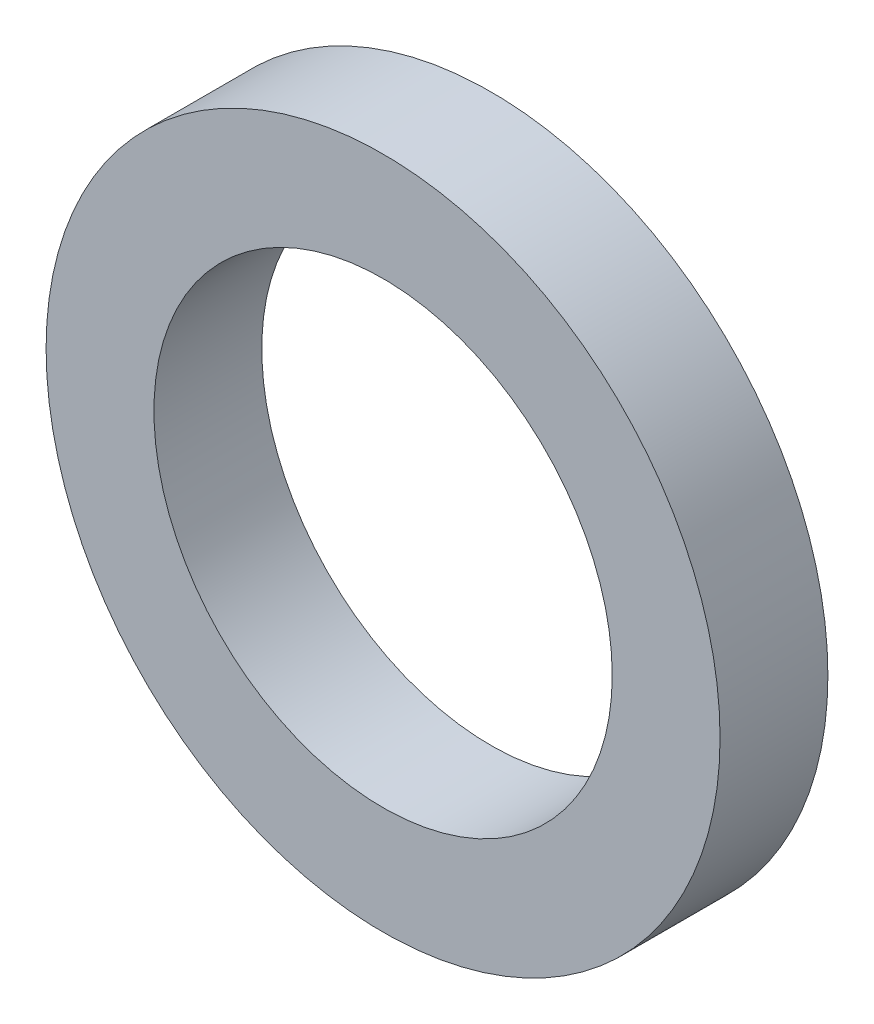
from build123d import *

# Parameters (mm, degrees)
SKETCH_1_R      = 12.5
SKETCH_1_R_2    = 8.5
EXTRUDE_1_DEPTH = 4


with BuildPart() as part:
    # Sketch 1 → Extrude 1 (new body)
    with BuildSketch(Plane.XY):
        Circle(SKETCH_1_R)
        Circle(SKETCH_1_R_2, mode=Mode.SUBTRACT)
    extrude(amount=EXTRUDE_1_DEPTH)


solid = part.part
